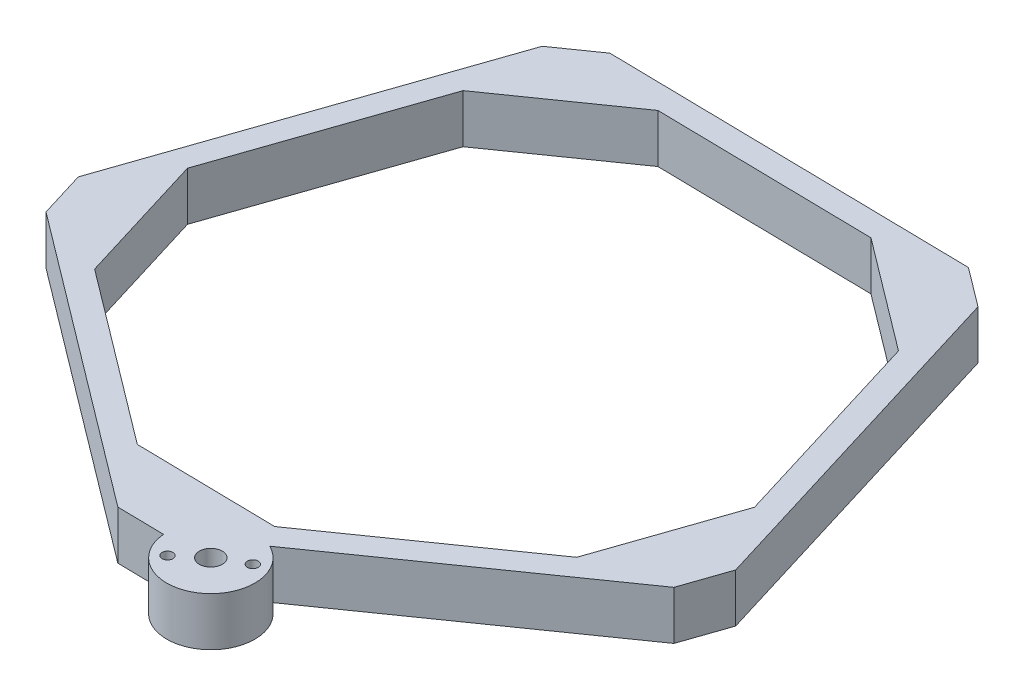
from build123d import *

# Parameters (mm, degrees)
BOSS_EXTRUDE1_DEPTH   = 12.7
SKETCH2_R             = 11.5
BOSS_EXTRUDE2_DEPTH   = 12.7
SKETCH3_R             = 3
CUT_EXTRUDE1_DEPTH    = 135.080153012
F_4_40_TAPPED_HOLE1_D = 2.8448
BOSS_EXTRUDE3_DEPTH   = 12.7
CIRPATTERN1_COUNT     = 5


with BuildPart() as part:
    # Sketch1 → Boss-Extrude1 (new body)
    with BuildSketch(Plane(origin=(0, 0, 0), x_dir=(1, 0, 0), z_dir=(0, 1, 0))):
        Polygon((87.024565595, -23.249069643), (82.889850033, -35.257155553), (4.780890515, -89.94963781), (-7.917175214, -89.727992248), (-84.06981276, -32.342863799), (-87.78293341, -20.197793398), (-56.738892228, 69.960648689), (-46.335661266, 77.24506943), (49.003248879, 75.580922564), (59.145919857, 67.93787177), align=None)
        Polygon((-51.406574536, 65.942459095), (-81.107165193, -20.314319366), (-78.600510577, -28.513217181), (-5.743426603, -83.414967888), (2.828787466, -83.564596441), (77.55753234, -31.238965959), (80.348797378, -23.132543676), (53.676617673, 64.108225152), (46.829500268, 69.267898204), (-44.383558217, 70.860028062), align=None, mode=Mode.SUBTRACT)
    extrude(amount=BOSS_EXTRUDE1_DEPTH)

    # Sketch2 → Boss-Extrude2 (add)
    with BuildSketch(Plane(origin=(0, 12.7, 0), x_dir=(1, 0, 0), z_dir=(0, 1, 0))):
        with Locations((15.701962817, -89.050256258)):
            Circle(SKETCH2_R)
    extrude(amount=-BOSS_EXTRUDE2_DEPTH)

    # Sketch3 → Cut-Extrude1 (cut, through all)
    with BuildSketch(Plane(origin=(0, 12.7, 0), x_dir=(1, 0, 0), z_dir=(0, 1, 0))):
        with Locations(Location((15.701962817, -89.050256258, 0), (0, 0, 270))):
            Circle(SKETCH3_R)
    extrude(amount=-CUT_EXTRUDE1_DEPTH, mode=Mode.SUBTRACT)

    # 4-40 Tapped Hole1 (through all)
    with Locations(Plane(origin=(0, 12.7, 0), x_dir=(1, 0, 0), z_dir=(0, 1, 0))):
        with Locations((9.550249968, -94.21227418), (22.656682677, -85.035051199)):
            Hole(F_4_40_TAPPED_HOLE1_D / 2)

    # Sketch6 → Boss-Extrude3 (add)
    with BuildSketch(Plane(origin=(0, 12.7, 0), x_dir=(1, 0, 0), z_dir=(0, 1, 0))):
        Polygon((80.348797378, -23.132543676), (75.295086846, -6.602601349), (63.398305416, -41.153363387), (77.55753234, -31.238965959), align=None)
    boss_extrude3 = extrude(amount=-BOSS_EXTRUDE3_DEPTH)

    # CirPattern1: Boss-Extrude3 ×5 about axis
    cirpattern1_axis = Axis((0, 0, 0), (0, 1, 0))
    for i in range(1, CIRPATTERN1_COUNT):
        add(boss_extrude3.rotate(cirpattern1_axis, i * 360 / CIRPATTERN1_COUNT))


solid = part.part
